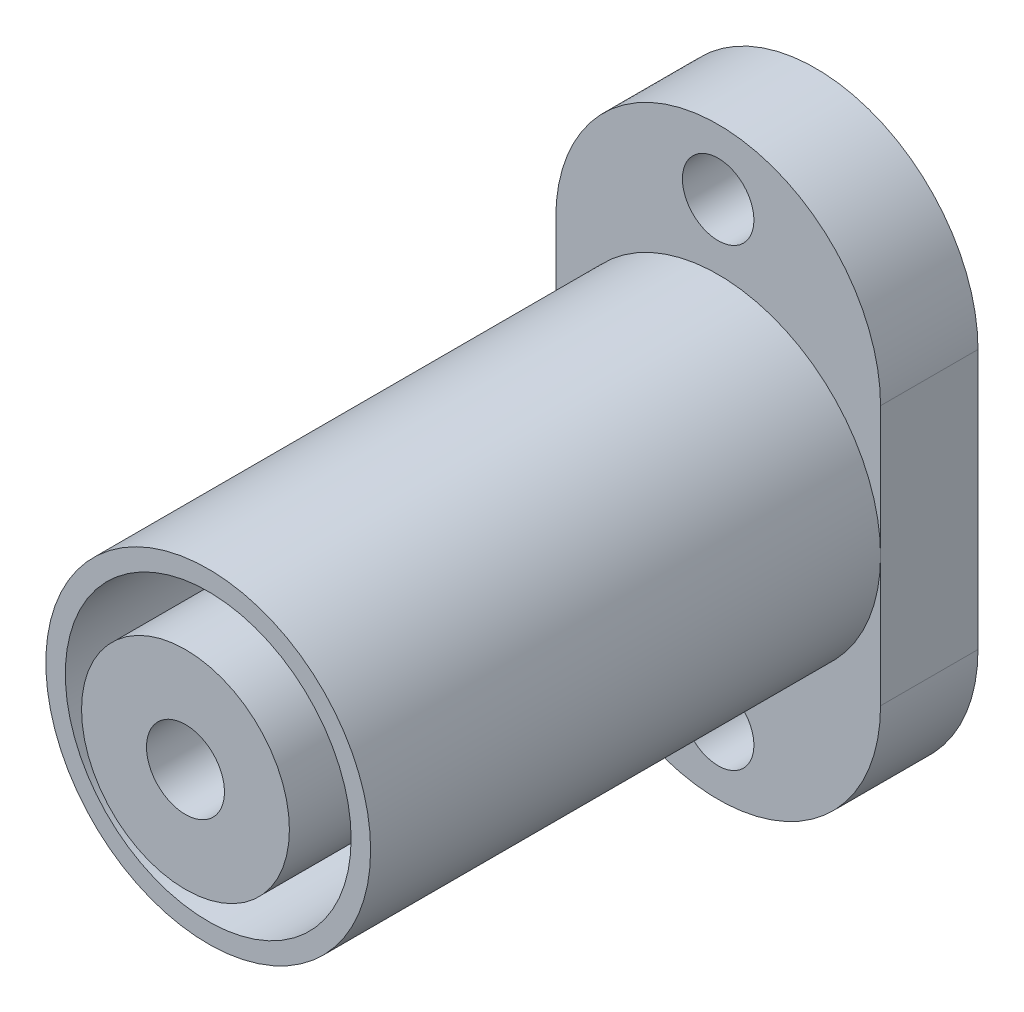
ISO-10303-21;
HEADER;
FILE_DESCRIPTION(('STEP AP214'),'2;1');
FILE_NAME('part.step','',(''),(''),'','','');
FILE_SCHEMA(('AUTOMOTIVE_DESIGN { 1 0 10303 214 1 1 1 1 }'));
ENDSEC;
DATA;
#1=APPLICATION_CONTEXT('core data for automotive mechanical design processes');
#2=APPLICATION_PROTOCOL_DEFINITION('international standard','automotive_design',2000,#1);
#3=PRODUCT_CONTEXT('',#1,'mechanical');
#4=PRODUCT('Part','Part','',(#3));
#5=PRODUCT_RELATED_PRODUCT_CATEGORY('part','',(#4));
#6=PRODUCT_DEFINITION_FORMATION('','',#4);
#7=PRODUCT_DEFINITION_CONTEXT('part definition',#1,'design');
#8=PRODUCT_DEFINITION('design','',#6,#7);
#9=PRODUCT_DEFINITION_SHAPE('','',#8);
#10=(LENGTH_UNIT() NAMED_UNIT(*) SI_UNIT(.MILLI.,.METRE.));
#11=(NAMED_UNIT(*) PLANE_ANGLE_UNIT() SI_UNIT($,.RADIAN.));
#12=(NAMED_UNIT(*) SI_UNIT($,.STERADIAN.) SOLID_ANGLE_UNIT());
#13=UNCERTAINTY_MEASURE_WITH_UNIT(LENGTH_MEASURE(1.E-05),#10,'distance_accuracy_value','');
#14=(GEOMETRIC_REPRESENTATION_CONTEXT(3) GLOBAL_UNCERTAINTY_ASSIGNED_CONTEXT((#13)) GLOBAL_UNIT_ASSIGNED_CONTEXT((#10,
#11,#12)) REPRESENTATION_CONTEXT('',''));
#15=CARTESIAN_POINT('',(0.,0.,0.));
#16=DIRECTION('',(0.,0.,1.));
#17=DIRECTION('',(1.,0.,0.));
#18=AXIS2_PLACEMENT_3D('',#15,#16,#17);
#19=CARTESIAN_POINT('',(0.,0.,93.5));
#20=DIRECTION('',(0.,0.,-1.));
#21=DIRECTION('',(1.,0.,0.));
#22=AXIS2_PLACEMENT_3D('',#19,#20,#21);
#23=CYLINDRICAL_SURFACE('',#22,22.);
#24=CARTESIAN_POINT('',(0.,0.,23.));
#25=DIRECTION('',(0.,0.,-1.));
#26=DIRECTION('',(1.,0.,0.));
#27=AXIS2_PLACEMENT_3D('',#24,#25,#26);
#28=CIRCLE('',#27,22.);
#29=CARTESIAN_POINT('',(22.,0.,23.));
#30=VERTEX_POINT('',#29);
#31=EDGE_CURVE('E142',#30,#30,#28,.T.);
#32=ORIENTED_EDGE('',*,*,#31,.T.);
#33=EDGE_LOOP('',(#32));
#34=FACE_BOUND('',#33,.T.);
#35=CARTESIAN_POINT('',(0.,0.,93.5));
#36=DIRECTION('',(0.,0.,-1.));
#37=DIRECTION('',(1.,0.,0.));
#38=AXIS2_PLACEMENT_3D('',#35,#36,#37);
#39=CIRCLE('',#38,22.);
#40=CARTESIAN_POINT('',(22.,0.,93.5));
#41=VERTEX_POINT('',#40);
#42=EDGE_CURVE('E140',#41,#41,#39,.T.);
#43=ORIENTED_EDGE('',*,*,#42,.F.);
#44=EDGE_LOOP('',(#43));
#45=FACE_BOUND('',#44,.T.);
#46=ADVANCED_FACE('F14',(#34,#45),#23,.F.);
#47=CARTESIAN_POINT('',(-22.264,22.264,23.));
#48=DIRECTION('',(0.,0.,-1.));
#49=DIRECTION('',(1.,0.,0.));
#50=AXIS2_PLACEMENT_3D('',#47,#48,#49);
#51=PLANE('',#50);
#52=CARTESIAN_POINT('',(0.,0.,23.));
#53=DIRECTION('',(0.,0.,1.));
#54=DIRECTION('',(-1.,0.,0.));
#55=AXIS2_PLACEMENT_3D('',#52,#53,#54);
#56=CIRCLE('',#55,16.);
#57=CARTESIAN_POINT('',(-16.,0.,23.));
#58=VERTEX_POINT('',#57);
#59=EDGE_CURVE('E137',#58,#58,#56,.F.);
#60=ORIENTED_EDGE('',*,*,#59,.T.);
#61=EDGE_LOOP('',(#60));
#62=FACE_BOUND('',#61,.T.);
#63=ORIENTED_EDGE('',*,*,#31,.F.);
#64=EDGE_LOOP('',(#63));
#65=FACE_BOUND('',#64,.T.);
#66=ADVANCED_FACE('F202',(#62,#65),#51,.F.);
#67=CARTESIAN_POINT('',(-25.3,-25.3,93.5));
#68=DIRECTION('',(0.,0.,1.));
#69=DIRECTION('',(1.,0.,0.));
#70=AXIS2_PLACEMENT_3D('',#67,#68,#69);
#71=PLANE('',#70);
#72=ORIENTED_EDGE('',*,*,#42,.T.);
#73=EDGE_LOOP('',(#72));
#74=FACE_BOUND('',#73,.T.);
#75=CARTESIAN_POINT('',(0.,0.,93.5));
#76=DIRECTION('',(0.,0.,-1.));
#77=DIRECTION('',(1.,0.,0.));
#78=AXIS2_PLACEMENT_3D('',#75,#76,#77);
#79=CIRCLE('',#78,25.);
#80=CARTESIAN_POINT('',(25.,0.,93.5));
#81=VERTEX_POINT('',#80);
#82=EDGE_CURVE('E134',#81,#81,#79,.F.);
#83=ORIENTED_EDGE('',*,*,#82,.T.);
#84=EDGE_LOOP('',(#83));
#85=FACE_BOUND('',#84,.T.);
#86=ADVANCED_FACE('F205',(#74,#85),#71,.T.);
#87=CARTESIAN_POINT('',(0.,0.,23.));
#88=DIRECTION('',(0.,0.,1.));
#89=DIRECTION('',(-1.,0.,0.));
#90=AXIS2_PLACEMENT_3D('',#87,#88,#89);
#91=CYLINDRICAL_SURFACE('',#90,16.);
#92=ORIENTED_EDGE('',*,*,#59,.F.);
#93=EDGE_LOOP('',(#92));
#94=FACE_BOUND('',#93,.T.);
#95=CARTESIAN_POINT('',(0.,0.,97.));
#96=DIRECTION('',(0.,0.,1.));
#97=DIRECTION('',(-1.,0.,0.));
#98=AXIS2_PLACEMENT_3D('',#95,#96,#97);
#99=CIRCLE('',#98,16.);
#100=CARTESIAN_POINT('',(-16.,0.,97.));
#101=VERTEX_POINT('',#100);
#102=EDGE_CURVE('E83',#101,#101,#99,.F.);
#103=ORIENTED_EDGE('',*,*,#102,.T.);
#104=EDGE_LOOP('',(#103));
#105=FACE_BOUND('',#104,.T.);
#106=ADVANCED_FACE('F209',(#94,#105),#91,.T.);
#107=CARTESIAN_POINT('',(0.,0.,93.5));
#108=DIRECTION('',(0.,0.,-1.));
#109=DIRECTION('',(1.,0.,0.));
#110=AXIS2_PLACEMENT_3D('',#107,#108,#109);
#111=CYLINDRICAL_SURFACE('',#110,25.);
#112=ORIENTED_EDGE('',*,*,#82,.F.);
#113=EDGE_LOOP('',(#112));
#114=FACE_BOUND('',#113,.T.);
#115=CARTESIAN_POINT('',(0.,0.,15.));
#116=DIRECTION('',(0.,0.,-1.));
#117=DIRECTION('',(1.,0.,0.));
#118=AXIS2_PLACEMENT_3D('',#115,#116,#117);
#119=CIRCLE('',#118,25.);
#120=CARTESIAN_POINT('',(25.,2.24484071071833E-09,15.));
#121=VERTEX_POINT('',#120);
#122=CARTESIAN_POINT('',(-25.,5.12758571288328E-09,15.));
#123=VERTEX_POINT('',#122);
#124=EDGE_CURVE('E69',#121,#123,#119,.T.);
#125=ORIENTED_EDGE('',*,*,#124,.F.);
#126=CARTESIAN_POINT('',(0.,0.,15.));
#127=DIRECTION('',(0.,0.,-1.));
#128=DIRECTION('',(1.,0.,0.));
#129=AXIS2_PLACEMENT_3D('',#126,#127,#128);
#130=CIRCLE('',#129,25.);
#131=EDGE_CURVE('E60',#123,#121,#130,.T.);
#132=ORIENTED_EDGE('',*,*,#131,.F.);
#133=EDGE_LOOP('',(#125,#132));
#134=FACE_BOUND('',#133,.T.);
#135=ADVANCED_FACE('F80',(#114,#134),#111,.T.);
#136=CARTESIAN_POINT('',(-16.192,16.192,97.));
#137=DIRECTION('',(0.,0.,-1.));
#138=DIRECTION('',(1.,0.,0.));
#139=AXIS2_PLACEMENT_3D('',#136,#137,#138);
#140=PLANE('',#139);
#141=CARTESIAN_POINT('',(0.,0.,97.));
#142=DIRECTION('',(0.,0.,1.));
#143=DIRECTION('',(-1.,0.,0.));
#144=AXIS2_PLACEMENT_3D('',#141,#142,#143);
#145=CIRCLE('',#144,6.);
#146=CARTESIAN_POINT('',(-6.,0.,97.));
#147=VERTEX_POINT('',#146);
#148=EDGE_CURVE('E147',#147,#147,#145,.T.);
#149=ORIENTED_EDGE('',*,*,#148,.F.);
#150=EDGE_LOOP('',(#149));
#151=FACE_BOUND('',#150,.T.);
#152=ORIENTED_EDGE('',*,*,#102,.F.);
#153=EDGE_LOOP('',(#152));
#154=FACE_BOUND('',#153,.T.);
#155=ADVANCED_FACE('F211',(#151,#154),#140,.F.);
#156=CARTESIAN_POINT('',(25.,0.270000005,15.));
#157=DIRECTION('',(0.,0.,1.));
#158=DIRECTION('',(-1.,0.,0.));
#159=AXIS2_PLACEMENT_3D('',#156,#157,#158);
#160=PLANE('',#159);
#161=CARTESIAN_POINT('',(0.,-35.,15.));
#162=DIRECTION('',(0.,0.,1.));
#163=DIRECTION('',(-1.,0.,0.));
#164=AXIS2_PLACEMENT_3D('',#161,#162,#163);
#165=CIRCLE('',#164,5.5);
#166=CARTESIAN_POINT('',(-5.5,-35.,15.));
#167=VERTEX_POINT('',#166);
#168=EDGE_CURVE('E125',#167,#167,#165,.T.);
#169=ORIENTED_EDGE('',*,*,#168,.F.);
#170=EDGE_LOOP('',(#169));
#171=FACE_BOUND('',#170,.T.);
#172=DIRECTION('',(0.,1.,0.));
#173=VECTOR('',#172,1.);
#174=CARTESIAN_POINT('',(-25.,1.00000042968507E-09,15.));
#175=LINE('',#174,#173);
#176=CARTESIAN_POINT('',(-25.,-19.9999999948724,15.));
#177=VERTEX_POINT('',#176);
#178=EDGE_CURVE('E68',#177,#123,#175,.T.);
#179=ORIENTED_EDGE('',*,*,#178,.F.);
#180=CARTESIAN_POINT('',(0.,-20.,15.));
#181=DIRECTION('',(0.,0.,-1.));
#182=DIRECTION('',(0.,-1.,0.));
#183=AXIS2_PLACEMENT_3D('',#180,#181,#182);
#184=CIRCLE('',#183,25.);
#185=CARTESIAN_POINT('',(25.,-20.,15.));
#186=VERTEX_POINT('',#185);
#187=EDGE_CURVE('E77',#177,#186,#184,.F.);
#188=ORIENTED_EDGE('',*,*,#187,.T.);
#189=DIRECTION('',(0.,-1.,0.));
#190=VECTOR('',#189,1.);
#191=CARTESIAN_POINT('',(25.,2.50000020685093E-09,15.));
#192=LINE('',#191,#190);
#193=EDGE_CURVE('E74',#121,#186,#192,.T.);
#194=ORIENTED_EDGE('',*,*,#193,.F.);
#195=ORIENTED_EDGE('',*,*,#124,.T.);
#196=EDGE_LOOP('',(#179,#188,#194,#195));
#197=FACE_BOUND('',#196,.T.);
#198=ADVANCED_FACE('F85',(#171,#197),#160,.T.);
#199=CARTESIAN_POINT('',(25.,45.27,15.));
#200=DIRECTION('',(0.,0.,1.));
#201=DIRECTION('',(-1.,0.,0.));
#202=AXIS2_PLACEMENT_3D('',#199,#200,#201);
#203=PLANE('',#202);
#204=CARTESIAN_POINT('',(0.,35.,15.));
#205=DIRECTION('',(0.,0.,1.));
#206=DIRECTION('',(-1.,0.,0.));
#207=AXIS2_PLACEMENT_3D('',#204,#205,#206);
#208=CIRCLE('',#207,5.5);
#209=CARTESIAN_POINT('',(-5.5,35.,15.));
#210=VERTEX_POINT('',#209);
#211=EDGE_CURVE('E122',#210,#210,#208,.T.);
#212=ORIENTED_EDGE('',*,*,#211,.F.);
#213=EDGE_LOOP('',(#212));
#214=FACE_BOUND('',#213,.T.);
#215=DIRECTION('',(0.,-1.,0.));
#216=VECTOR('',#215,1.);
#217=CARTESIAN_POINT('',(25.,2.50000020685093E-09,15.));
#218=LINE('',#217,#216);
#219=CARTESIAN_POINT('',(25.,20.0000000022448,15.));
#220=VERTEX_POINT('',#219);
#221=EDGE_CURVE('E64',#220,#121,#218,.T.);
#222=ORIENTED_EDGE('',*,*,#221,.F.);
#223=CARTESIAN_POINT('',(0.,20.,15.));
#224=DIRECTION('',(0.,0.,-1.));
#225=DIRECTION('',(0.,-1.,0.));
#226=AXIS2_PLACEMENT_3D('',#223,#224,#225);
#227=CIRCLE('',#226,25.);
#228=CARTESIAN_POINT('',(-25.,20.0000000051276,15.));
#229=VERTEX_POINT('',#228);
#230=EDGE_CURVE('E128',#220,#229,#227,.F.);
#231=ORIENTED_EDGE('',*,*,#230,.T.);
#232=DIRECTION('',(0.,1.,0.));
#233=VECTOR('',#232,1.);
#234=CARTESIAN_POINT('',(-25.,1.00000042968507E-09,15.));
#235=LINE('',#234,#233);
#236=EDGE_CURVE('E65',#123,#229,#235,.T.);
#237=ORIENTED_EDGE('',*,*,#236,.F.);
#238=ORIENTED_EDGE('',*,*,#131,.T.);
#239=EDGE_LOOP('',(#222,#231,#237,#238));
#240=FACE_BOUND('',#239,.T.);
#241=ADVANCED_FACE('F62',(#214,#240),#203,.T.);
#242=CARTESIAN_POINT('',(-25.,20.,0.));
#243=DIRECTION('',(-1.,0.,0.));
#244=DIRECTION('',(0.,-1.,0.));
#245=AXIS2_PLACEMENT_3D('',#242,#243,#244);
#246=PLANE('',#245);
#247=DIRECTION('',(0.,0.,1.));
#248=VECTOR('',#247,1.);
#249=CARTESIAN_POINT('',(-25.,20.0000000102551,7.5));
#250=LINE('',#249,#248);
#251=CARTESIAN_POINT('',(-25.,20.0000000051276,0.));
#252=VERTEX_POINT('',#251);
#253=EDGE_CURVE('E90',#229,#252,#250,.F.);
#254=ORIENTED_EDGE('',*,*,#253,.T.);
#255=DIRECTION('',(0.,-1.,0.));
#256=VECTOR('',#255,1.);
#257=CARTESIAN_POINT('',(-25.,0.,0.));
#258=LINE('',#257,#256);
#259=CARTESIAN_POINT('',(-25.,-19.9999999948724,0.));
#260=VERTEX_POINT('',#259);
#261=EDGE_CURVE('E121',#252,#260,#258,.T.);
#262=ORIENTED_EDGE('',*,*,#261,.T.);
#263=DIRECTION('',(0.,0.,-1.));
#264=VECTOR('',#263,1.);
#265=CARTESIAN_POINT('',(-25.,-19.9999999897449,7.5));
#266=LINE('',#265,#264);
#267=EDGE_CURVE('E130',#260,#177,#266,.F.);
#268=ORIENTED_EDGE('',*,*,#267,.T.);
#269=ORIENTED_EDGE('',*,*,#178,.T.);
#270=ORIENTED_EDGE('',*,*,#236,.T.);
#271=EDGE_LOOP('',(#254,#262,#268,#269,#270));
#272=FACE_BOUND('',#271,.T.);
#273=ADVANCED_FACE('F164',(#272),#246,.T.);
#274=CARTESIAN_POINT('',(0.,-20.,15.));
#275=DIRECTION('',(0.,0.,-1.));
#276=DIRECTION('',(0.,-1.,0.));
#277=AXIS2_PLACEMENT_3D('',#274,#275,#276);
#278=CYLINDRICAL_SURFACE('',#277,25.);
#279=ORIENTED_EDGE('',*,*,#267,.F.);
#280=CARTESIAN_POINT('',(0.,-20.,0.));
#281=DIRECTION('',(0.,0.,-1.));
#282=DIRECTION('',(0.,-1.,0.));
#283=AXIS2_PLACEMENT_3D('',#280,#281,#282);
#284=CIRCLE('',#283,25.);
#285=CARTESIAN_POINT('',(25.,-20.,0.));
#286=VERTEX_POINT('',#285);
#287=EDGE_CURVE('E118',#260,#286,#284,.F.);
#288=ORIENTED_EDGE('',*,*,#287,.T.);
#289=DIRECTION('',(0.,0.,-1.));
#290=VECTOR('',#289,1.);
#291=CARTESIAN_POINT('',(25.,-20.,7.5));
#292=LINE('',#291,#290);
#293=EDGE_CURVE('E88',#186,#286,#292,.T.);
#294=ORIENTED_EDGE('',*,*,#293,.F.);
#295=ORIENTED_EDGE('',*,*,#187,.F.);
#296=EDGE_LOOP('',(#279,#288,#294,#295));
#297=FACE_BOUND('',#296,.T.);
#298=ADVANCED_FACE('F171',(#297),#278,.T.);
#299=CARTESIAN_POINT('',(25.,-20.,0.));
#300=DIRECTION('',(1.,0.,0.));
#301=DIRECTION('',(0.,1.,0.));
#302=AXIS2_PLACEMENT_3D('',#299,#300,#301);
#303=PLANE('',#302);
#304=ORIENTED_EDGE('',*,*,#293,.T.);
#305=DIRECTION('',(0.,1.,0.));
#306=VECTOR('',#305,1.);
#307=CARTESIAN_POINT('',(25.,0.,0.));
#308=LINE('',#307,#306);
#309=CARTESIAN_POINT('',(25.,20.0000000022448,0.));
#310=VERTEX_POINT('',#309);
#311=EDGE_CURVE('E117',#286,#310,#308,.T.);
#312=ORIENTED_EDGE('',*,*,#311,.T.);
#313=DIRECTION('',(0.,0.,-1.));
#314=VECTOR('',#313,1.);
#315=CARTESIAN_POINT('',(25.,20.0000000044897,7.5));
#316=LINE('',#315,#314);
#317=EDGE_CURVE('E33',#310,#220,#316,.F.);
#318=ORIENTED_EDGE('',*,*,#317,.T.);
#319=ORIENTED_EDGE('',*,*,#221,.T.);
#320=ORIENTED_EDGE('',*,*,#193,.T.);
#321=EDGE_LOOP('',(#304,#312,#318,#319,#320));
#322=FACE_BOUND('',#321,.T.);
#323=ADVANCED_FACE('F72',(#322),#303,.T.);
#324=CARTESIAN_POINT('',(0.,20.,15.));
#325=DIRECTION('',(0.,0.,-1.));
#326=DIRECTION('',(0.,-1.,0.));
#327=AXIS2_PLACEMENT_3D('',#324,#325,#326);
#328=CYLINDRICAL_SURFACE('',#327,25.);
#329=ORIENTED_EDGE('',*,*,#317,.F.);
#330=CARTESIAN_POINT('',(0.,20.,0.));
#331=DIRECTION('',(0.,0.,-1.));
#332=DIRECTION('',(0.,-1.,0.));
#333=AXIS2_PLACEMENT_3D('',#330,#331,#332);
#334=CIRCLE('',#333,25.);
#335=EDGE_CURVE('E115',#310,#252,#334,.F.);
#336=ORIENTED_EDGE('',*,*,#335,.T.);
#337=ORIENTED_EDGE('',*,*,#253,.F.);
#338=ORIENTED_EDGE('',*,*,#230,.F.);
#339=EDGE_LOOP('',(#329,#336,#337,#338));
#340=FACE_BOUND('',#339,.T.);
#341=ADVANCED_FACE('F165',(#340),#328,.T.);
#342=CARTESIAN_POINT('',(0.,-35.,0.));
#343=DIRECTION('',(0.,0.,1.));
#344=DIRECTION('',(-1.,0.,0.));
#345=AXIS2_PLACEMENT_3D('',#342,#343,#344);
#346=CYLINDRICAL_SURFACE('',#345,5.5);
#347=ORIENTED_EDGE('',*,*,#168,.T.);
#348=EDGE_LOOP('',(#347));
#349=FACE_BOUND('',#348,.T.);
#350=CARTESIAN_POINT('',(0.,-35.,0.));
#351=DIRECTION('',(0.,0.,1.));
#352=DIRECTION('',(-1.,0.,0.));
#353=AXIS2_PLACEMENT_3D('',#350,#351,#352);
#354=CIRCLE('',#353,5.5);
#355=CARTESIAN_POINT('',(-5.5,-35.,0.));
#356=VERTEX_POINT('',#355);
#357=EDGE_CURVE('E112',#356,#356,#354,.F.);
#358=ORIENTED_EDGE('',*,*,#357,.T.);
#359=EDGE_LOOP('',(#358));
#360=FACE_BOUND('',#359,.T.);
#361=ADVANCED_FACE('F248',(#349,#360),#346,.F.);
#362=CARTESIAN_POINT('',(0.,35.,0.));
#363=DIRECTION('',(0.,0.,1.));
#364=DIRECTION('',(-1.,0.,0.));
#365=AXIS2_PLACEMENT_3D('',#362,#363,#364);
#366=CYLINDRICAL_SURFACE('',#365,5.5);
#367=ORIENTED_EDGE('',*,*,#211,.T.);
#368=EDGE_LOOP('',(#367));
#369=FACE_BOUND('',#368,.T.);
#370=CARTESIAN_POINT('',(0.,35.,0.));
#371=DIRECTION('',(0.,0.,1.));
#372=DIRECTION('',(-1.,0.,0.));
#373=AXIS2_PLACEMENT_3D('',#370,#371,#372);
#374=CIRCLE('',#373,5.5);
#375=CARTESIAN_POINT('',(-5.5,35.,0.));
#376=VERTEX_POINT('',#375);
#377=EDGE_CURVE('E109',#376,#376,#374,.F.);
#378=ORIENTED_EDGE('',*,*,#377,.T.);
#379=EDGE_LOOP('',(#378));
#380=FACE_BOUND('',#379,.T.);
#381=ADVANCED_FACE('F224',(#369,#380),#366,.F.);
#382=CARTESIAN_POINT('',(-10.626,10.626,59.));
#383=DIRECTION('',(0.,0.,-1.));
#384=DIRECTION('',(1.,0.,0.));
#385=AXIS2_PLACEMENT_3D('',#382,#383,#384);
#386=PLANE('',#385);
#387=CARTESIAN_POINT('',(0.,0.,59.));
#388=DIRECTION('',(0.,0.,-1.));
#389=DIRECTION('',(1.,0.,0.));
#390=AXIS2_PLACEMENT_3D('',#387,#388,#389);
#391=CIRCLE('',#390,6.);
#392=CARTESIAN_POINT('',(6.,0.,59.));
#393=VERTEX_POINT('',#392);
#394=EDGE_CURVE('E18',#393,#393,#391,.T.);
#395=ORIENTED_EDGE('',*,*,#394,.F.);
#396=EDGE_LOOP('',(#395));
#397=FACE_BOUND('',#396,.T.);
#398=CARTESIAN_POINT('',(0.,0.,59.));
#399=DIRECTION('',(0.,0.,-1.));
#400=DIRECTION('',(0.,-1.,0.));
#401=AXIS2_PLACEMENT_3D('',#398,#399,#400);
#402=CIRCLE('',#401,10.5);
#403=CARTESIAN_POINT('',(0.,-10.5,59.));
#404=VERTEX_POINT('',#403);
#405=EDGE_CURVE('E106',#404,#404,#402,.F.);
#406=ORIENTED_EDGE('',*,*,#405,.F.);
#407=EDGE_LOOP('',(#406));
#408=FACE_BOUND('',#407,.T.);
#409=ADVANCED_FACE('F221',(#397,#408),#386,.T.);
#410=CARTESIAN_POINT('',(25.,45.54,0.));
#411=DIRECTION('',(0.,0.,1.));
#412=DIRECTION('',(-1.,0.,0.));
#413=AXIS2_PLACEMENT_3D('',#410,#411,#412);
#414=PLANE('',#413);
#415=CARTESIAN_POINT('',(0.,0.,0.));
#416=DIRECTION('',(0.,0.,-1.));
#417=DIRECTION('',(1.,0.,0.));
#418=AXIS2_PLACEMENT_3D('',#415,#416,#417);
#419=CIRCLE('',#418,13.);
#420=CARTESIAN_POINT('',(13.,0.,0.));
#421=VERTEX_POINT('',#420);
#422=EDGE_CURVE('E103',#421,#421,#419,.F.);
#423=ORIENTED_EDGE('',*,*,#422,.T.);
#424=EDGE_LOOP('',(#423));
#425=FACE_BOUND('',#424,.T.);
#426=ORIENTED_EDGE('',*,*,#377,.F.);
#427=EDGE_LOOP('',(#426));
#428=FACE_BOUND('',#427,.T.);
#429=ORIENTED_EDGE('',*,*,#357,.F.);
#430=EDGE_LOOP('',(#429));
#431=FACE_BOUND('',#430,.T.);
#432=ORIENTED_EDGE('',*,*,#311,.F.);
#433=ORIENTED_EDGE('',*,*,#287,.F.);
#434=ORIENTED_EDGE('',*,*,#261,.F.);
#435=ORIENTED_EDGE('',*,*,#335,.F.);
#436=EDGE_LOOP('',(#432,#433,#434,#435));
#437=FACE_BOUND('',#436,.T.);
#438=ADVANCED_FACE('F168',(#425,#428,#431,#437),#414,.F.);
#439=CARTESIAN_POINT('',(0.,0.,59.));
#440=DIRECTION('',(0.,0.,-1.));
#441=DIRECTION('',(0.,-1.,0.));
#442=AXIS2_PLACEMENT_3D('',#439,#440,#441);
#443=CYLINDRICAL_SURFACE('',#442,10.5);
#444=ORIENTED_EDGE('',*,*,#405,.T.);
#445=EDGE_LOOP('',(#444));
#446=FACE_BOUND('',#445,.T.);
#447=CARTESIAN_POINT('',(0.,0.,0.));
#448=DIRECTION('',(0.,0.,-1.));
#449=DIRECTION('',(0.,-1.,0.));
#450=AXIS2_PLACEMENT_3D('',#447,#448,#449);
#451=CIRCLE('',#450,10.5);
#452=CARTESIAN_POINT('',(0.,-10.5,0.));
#453=VERTEX_POINT('',#452);
#454=EDGE_CURVE('E100',#453,#453,#451,.T.);
#455=ORIENTED_EDGE('',*,*,#454,.T.);
#456=EDGE_LOOP('',(#455));
#457=FACE_BOUND('',#456,.T.);
#458=ADVANCED_FACE('F227',(#446,#457),#443,.F.);
#459=CARTESIAN_POINT('',(0.,0.,0.));
#460=DIRECTION('',(0.,0.,-1.));
#461=DIRECTION('',(1.,0.,0.));
#462=AXIS2_PLACEMENT_3D('',#459,#460,#461);
#463=CYLINDRICAL_SURFACE('',#462,13.);
#464=ORIENTED_EDGE('',*,*,#422,.F.);
#465=EDGE_LOOP('',(#464));
#466=FACE_BOUND('',#465,.T.);
#467=CARTESIAN_POINT('',(0.,0.,-10.));
#468=DIRECTION('',(0.,0.,-1.));
#469=DIRECTION('',(1.,0.,0.));
#470=AXIS2_PLACEMENT_3D('',#467,#468,#469);
#471=CIRCLE('',#470,13.);
#472=CARTESIAN_POINT('',(13.,0.,-10.));
#473=VERTEX_POINT('',#472);
#474=EDGE_CURVE('E97',#473,#473,#471,.F.);
#475=ORIENTED_EDGE('',*,*,#474,.T.);
#476=EDGE_LOOP('',(#475));
#477=FACE_BOUND('',#476,.T.);
#478=ADVANCED_FACE('F200',(#466,#477),#463,.T.);
#479=CARTESIAN_POINT('',(11.132,11.132,0.));
#480=DIRECTION('',(0.,0.,1.));
#481=DIRECTION('',(-1.,0.,0.));
#482=AXIS2_PLACEMENT_3D('',#479,#480,#481);
#483=PLANE('',#482);
#484=ORIENTED_EDGE('',*,*,#454,.F.);
#485=EDGE_LOOP('',(#484));
#486=FACE_BOUND('',#485,.T.);
#487=CARTESIAN_POINT('',(0.,0.,0.));
#488=DIRECTION('',(0.,0.,-1.));
#489=DIRECTION('',(1.,0.,0.));
#490=AXIS2_PLACEMENT_3D('',#487,#488,#489);
#491=CIRCLE('',#490,11.);
#492=CARTESIAN_POINT('',(11.,0.,0.));
#493=VERTEX_POINT('',#492);
#494=EDGE_CURVE('E24',#493,#493,#491,.F.);
#495=ORIENTED_EDGE('',*,*,#494,.F.);
#496=EDGE_LOOP('',(#495));
#497=FACE_BOUND('',#496,.T.);
#498=ADVANCED_FACE('F195',(#486,#497),#483,.F.);
#499=CARTESIAN_POINT('',(14.292707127,11.911305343,-10.));
#500=DIRECTION('',(0.,0.,1.));
#501=DIRECTION('',(-0.995895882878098,0.0905063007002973,0.));
#502=AXIS2_PLACEMENT_3D('',#499,#500,#501);
#503=PLANE('',#502);
#504=CARTESIAN_POINT('',(0.,0.,-10.));
#505=DIRECTION('',(0.,0.,-1.));
#506=DIRECTION('',(1.,0.,0.));
#507=AXIS2_PLACEMENT_3D('',#504,#505,#506);
#508=CIRCLE('',#507,11.);
#509=CARTESIAN_POINT('',(11.,0.,-10.));
#510=VERTEX_POINT('',#509);
#511=EDGE_CURVE('E9',#510,#510,#508,.T.);
#512=ORIENTED_EDGE('',*,*,#511,.F.);
#513=EDGE_LOOP('',(#512));
#514=FACE_BOUND('',#513,.T.);
#515=ORIENTED_EDGE('',*,*,#474,.F.);
#516=EDGE_LOOP('',(#515));
#517=FACE_BOUND('',#516,.T.);
#518=ADVANCED_FACE('F16',(#514,#517),#503,.F.);
#519=CARTESIAN_POINT('',(0.,0.,0.));
#520=DIRECTION('',(0.,0.,-1.));
#521=DIRECTION('',(1.,0.,0.));
#522=AXIS2_PLACEMENT_3D('',#519,#520,#521);
#523=CYLINDRICAL_SURFACE('',#522,11.);
#524=ORIENTED_EDGE('',*,*,#511,.T.);
#525=EDGE_LOOP('',(#524));
#526=FACE_BOUND('',#525,.T.);
#527=ORIENTED_EDGE('',*,*,#494,.T.);
#528=EDGE_LOOP('',(#527));
#529=FACE_BOUND('',#528,.T.);
#530=ADVANCED_FACE('F184',(#526,#529),#523,.F.);
#531=CARTESIAN_POINT('',(0.,0.,-10.));
#532=DIRECTION('',(0.,0.,1.));
#533=DIRECTION('',(-1.,0.,0.));
#534=AXIS2_PLACEMENT_3D('',#531,#532,#533);
#535=CYLINDRICAL_SURFACE('',#534,6.);
#536=ORIENTED_EDGE('',*,*,#394,.T.);
#537=EDGE_LOOP('',(#536));
#538=FACE_BOUND('',#537,.T.);
#539=ORIENTED_EDGE('',*,*,#148,.T.);
#540=EDGE_LOOP('',(#539));
#541=FACE_BOUND('',#540,.T.);
#542=ADVANCED_FACE('F186',(#538,#541),#535,.F.);
#543=CLOSED_SHELL('',(#46,#66,#86,#106,#135,#155,#198,#241,#273,#298,#323,#341,#361,#381,#409,
#438,#458,#478,#498,#518,#530,#542));
#544=MANIFOLD_SOLID_BREP('B1',#543);
#545=ADVANCED_BREP_SHAPE_REPRESENTATION('',(#18,#544),#14);
#546=SHAPE_DEFINITION_REPRESENTATION(#9,#545);
ENDSEC;
END-ISO-10303-21;
